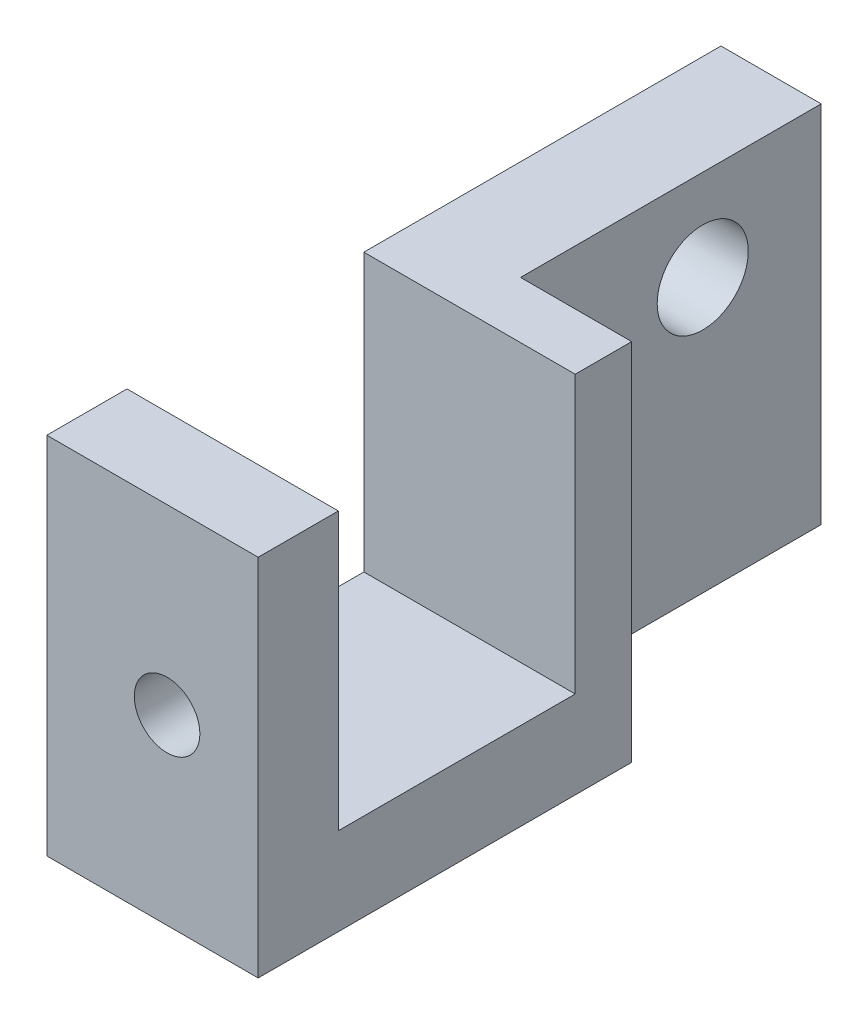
from build123d import *

# Parameters (mm, degrees)
SKETCH1_W           = 14.732
SKETCH1_H           = 46.99
BOSS_EXTRUDE1_DEPTH = 12.7
SKETCH2_W           = 16.51
SKETCH2_H           = 19.304
CUT_EXTRUDE1_DEPTH  = 31.501423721
CUT_EXTRUDE2_REACH  = 51.23
SKETCH3_R           = 2.286
SKETCH4_W           = 7.747
SKETCH4_H           = 25.4
CUT_EXTRUDE3_DEPTH  = 20.955
SKETCH5_R           = 3.175
CUT_EXTRUDE4_DEPTH  = 31.501423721


with BuildPart() as part:
    # Sketch1 → Boss-Extrude1 (new, symmetric)
    with BuildSketch(Plane(origin=(0, 0, 0), x_dir=(1, 0, 0), z_dir=(0, 1, 0))):
        Rectangle(SKETCH1_W, SKETCH1_H)
    extrude(amount=BOSS_EXTRUDE1_DEPTH, both=True)

    # Sketch2 → Cut-Extrude1 (cut, through all)
    with BuildSketch(Plane(origin=(7.366, 0, 0), x_dir=(0, 0, -1), z_dir=(1, 0, 0))):
        with Locations((-9.652, 3.048)):
            Rectangle(SKETCH2_W, SKETCH2_H)
    extrude(amount=-CUT_EXTRUDE1_DEPTH, mode=Mode.SUBTRACT)

    # Sketch3 → Cut-Extrude2 (cut, up to next)
    with BuildSketch(Plane.XY.offset(23.495), mode=Mode.PRIVATE) as cut_extrude2_sk1:
        with Locations((1.016, 0)):
            Circle(SKETCH3_R)
    cut_extrude2_tool1 = extrude(cut_extrude2_sk1.sketch, amount=-CUT_EXTRUDE2_REACH, mode=Mode.PRIVATE) & part.part
    add(cut_extrude2_tool1.solids().sort_by_distance((1.016, 0, 23.495))[0], mode=Mode.SUBTRACT)

    # Sketch4 → Cut-Extrude3 (cut)
    with BuildSketch(Plane(origin=(0, 0, -23.495), x_dir=(-1, 0, 0), z_dir=(0, 0, -1))):
        with Locations((-3.4925, 0)):
            Rectangle(SKETCH4_W, SKETCH4_H)
    extrude(amount=-CUT_EXTRUDE3_DEPTH, mode=Mode.SUBTRACT)

    # Sketch5 → Cut-Extrude4 (cut, through all)
    with BuildSketch(Plane.ZY.offset(7.366)):
        with Locations((-15.24, 6.35)):
            Circle(SKETCH5_R)
    extrude(amount=-CUT_EXTRUDE4_DEPTH, mode=Mode.SUBTRACT)


solid = part.part
